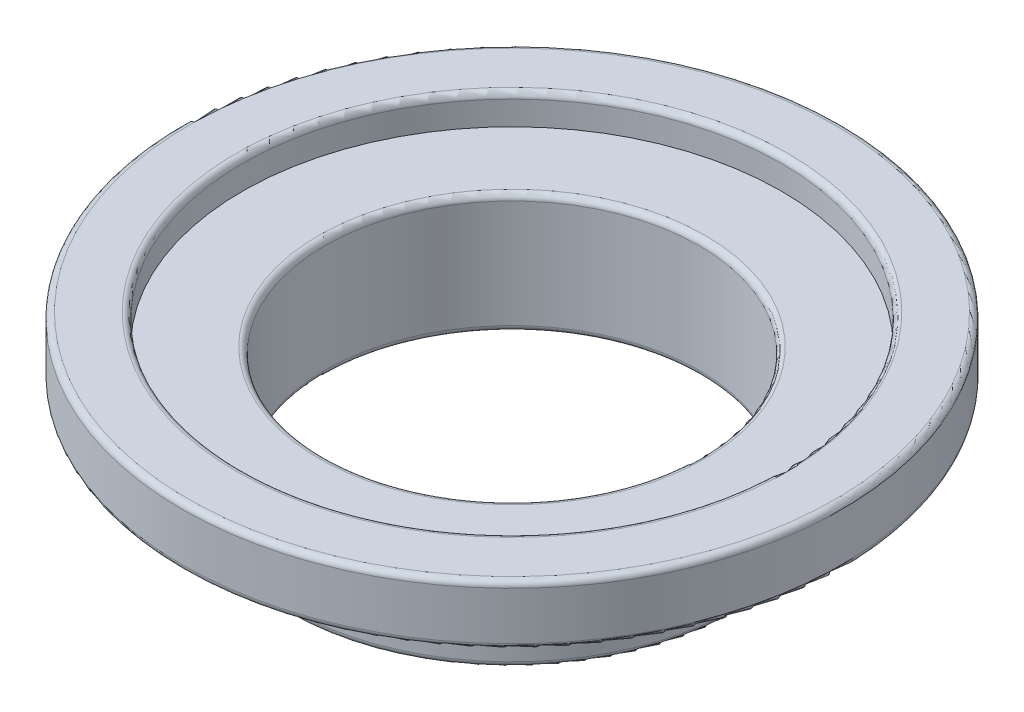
from build123d import *

# Parameters (mm, degrees)
FILLET1_R = 0.2


with BuildPart() as part:
    # Sketch1 → Revolve1 (revolve)
    with BuildSketch(Plane(origin=(0, 0, 0), x_dir=(0, 0, -1), z_dir=(1, 0, 0)), mode=Mode.PRIVATE) as revolve1_sk:
        Polygon((-7.5, 5.255), (-6.25, 5.255), (-6.25, 9.255), (-9, 9.255), (-9, 10.255), (-11, 10.255), (-11, 8.255), (-7.5, 8.255), align=None)
    revolve(revolve1_sk.sketch.rotate(Axis((0, 0, 0), (0, 1, 0)), 180), axis=Axis((0, 0, 0), (0, 1, 0)))

    # Fillet1
    fillet1_edges = [part.edges().sort_by_distance(p)[0] for p in [
        (0, 8.255, 11),
        (0, 10.255, 11),
        (0, 10.255, 9),
        (0, 9.255, 6.25),
        (0, 5.255, 6.25),
        (0, 5.255, 7.5),
    ]]
    fillet(fillet1_edges, radius=FILLET1_R)


solid = part.part
